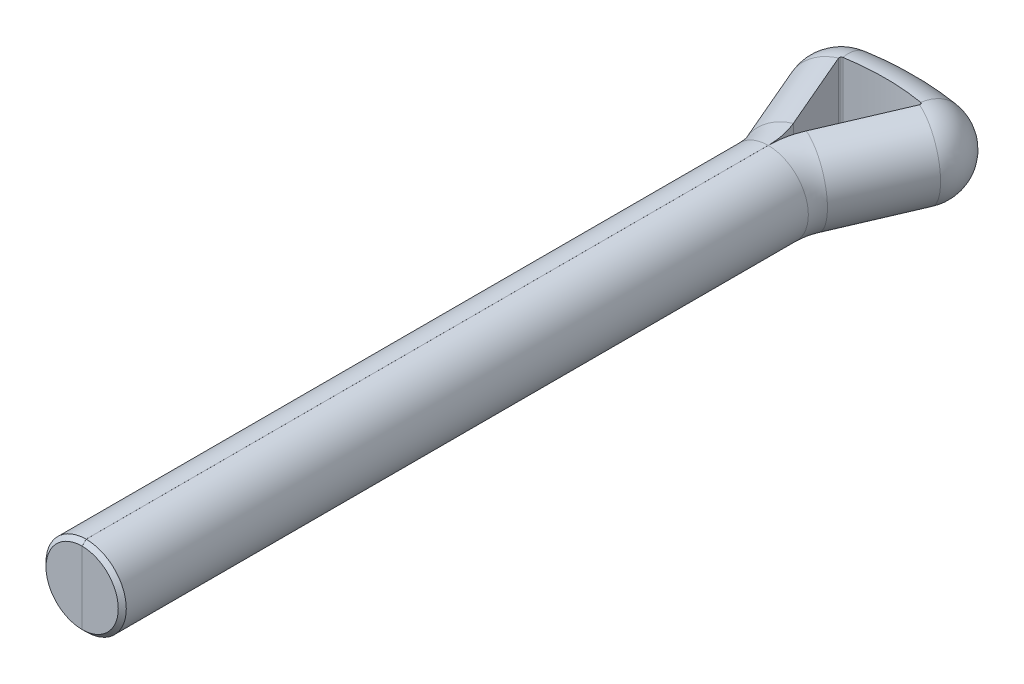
ISO-10303-21;
HEADER;
FILE_DESCRIPTION(('STEP AP214'),'2;1');
FILE_NAME('part.step','',(''),(''),'','','');
FILE_SCHEMA(('AUTOMOTIVE_DESIGN { 1 0 10303 214 1 1 1 1 }'));
ENDSEC;
DATA;
#1=APPLICATION_CONTEXT('core data for automotive mechanical design processes');
#2=APPLICATION_PROTOCOL_DEFINITION('international standard','automotive_design',2000,#1);
#3=PRODUCT_CONTEXT('',#1,'mechanical');
#4=PRODUCT('Part','Part','',(#3));
#5=PRODUCT_RELATED_PRODUCT_CATEGORY('part','',(#4));
#6=PRODUCT_DEFINITION_FORMATION('','',#4);
#7=PRODUCT_DEFINITION_CONTEXT('part definition',#1,'design');
#8=PRODUCT_DEFINITION('design','',#6,#7);
#9=PRODUCT_DEFINITION_SHAPE('','',#8);
#10=(LENGTH_UNIT() NAMED_UNIT(*) SI_UNIT(.MILLI.,.METRE.));
#11=(NAMED_UNIT(*) PLANE_ANGLE_UNIT() SI_UNIT($,.RADIAN.));
#12=(NAMED_UNIT(*) SI_UNIT($,.STERADIAN.) SOLID_ANGLE_UNIT());
#13=UNCERTAINTY_MEASURE_WITH_UNIT(LENGTH_MEASURE(1.E-05),#10,'distance_accuracy_value','');
#14=(GEOMETRIC_REPRESENTATION_CONTEXT(3) GLOBAL_UNCERTAINTY_ASSIGNED_CONTEXT((#13)) GLOBAL_UNIT_ASSIGNED_CONTEXT((#10,
#11,#12)) REPRESENTATION_CONTEXT('',''));
#15=CARTESIAN_POINT('',(0.,0.,0.));
#16=DIRECTION('',(0.,0.,1.));
#17=DIRECTION('',(1.,0.,0.));
#18=AXIS2_PLACEMENT_3D('',#15,#16,#17);
#19=CARTESIAN_POINT('',(0.,0.,-17.0892866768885));
#20=DIRECTION('',(0.,0.,1.));
#21=DIRECTION('',(1.,0.,0.));
#22=AXIS2_PLACEMENT_3D('',#19,#20,#21);
#23=CYLINDRICAL_SURFACE('',#22,1.);
#24=DIRECTION('',(0.,0.,1.));
#25=VECTOR('',#24,1.);
#26=CARTESIAN_POINT('',(0.000500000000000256,1.,-21.001));
#27=LINE('',#26,#25);
#28=CARTESIAN_POINT('',(0.000500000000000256,1.,-17.0892866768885));
#29=VERTEX_POINT('',#28);
#30=CARTESIAN_POINT('',(0.000500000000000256,1.,-0.100000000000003));
#31=VERTEX_POINT('',#30);
#32=EDGE_CURVE('E147',#29,#31,#27,.T.);
#33=ORIENTED_EDGE('',*,*,#32,.T.);
#34=CARTESIAN_POINT('',(0.,0.,-0.100000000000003));
#35=DIRECTION('',(0.,0.,1.));
#36=DIRECTION('',(1.,0.,0.));
#37=AXIS2_PLACEMENT_3D('',#34,#35,#36);
#38=CIRCLE('',#37,1.);
#39=CARTESIAN_POINT('',(0.000500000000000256,-1.,-0.100000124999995));
#40=VERTEX_POINT('',#39);
#41=EDGE_CURVE('E11',#31,#40,#38,.F.);
#42=ORIENTED_EDGE('',*,*,#41,.T.);
#43=DIRECTION('',(0.,0.,1.));
#44=VECTOR('',#43,1.);
#45=CARTESIAN_POINT('',(0.000500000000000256,-1.,-21.001));
#46=LINE('',#45,#44);
#47=CARTESIAN_POINT('',(0.000500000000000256,-1.,-17.0892866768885));
#48=VERTEX_POINT('',#47);
#49=EDGE_CURVE('E148',#48,#40,#46,.T.);
#50=ORIENTED_EDGE('',*,*,#49,.F.);
#51=CARTESIAN_POINT('',(0.,0.,-17.0892866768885));
#52=DIRECTION('',(0.,0.,1.));
#53=DIRECTION('',(1.,0.,0.));
#54=AXIS2_PLACEMENT_3D('',#51,#52,#53);
#55=CIRCLE('',#54,1.);
#56=EDGE_CURVE('E146',#48,#29,#55,.T.);
#57=ORIENTED_EDGE('',*,*,#56,.T.);
#58=EDGE_LOOP('',(#33,#42,#50,#57));
#59=FACE_BOUND('',#58,.T.);
#60=ADVANCED_FACE('F30',(#59),#23,.T.);
#61=CARTESIAN_POINT('',(0.,0.,0.));
#62=DIRECTION('',(0.,0.,1.));
#63=DIRECTION('',(1.,0.,0.));
#64=AXIS2_PLACEMENT_3D('',#61,#62,#63);
#65=PLANE('',#64);
#66=DIRECTION('',(0.,1.,0.));
#67=VECTOR('',#66,1.);
#68=CARTESIAN_POINT('',(0.000500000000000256,1.,0.));
#69=LINE('',#68,#67);
#70=CARTESIAN_POINT('',(0.000500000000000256,-0.8999998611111,0.));
#71=VERTEX_POINT('',#70);
#72=CARTESIAN_POINT('',(0.000500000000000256,0.8999998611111,0.));
#73=VERTEX_POINT('',#72);
#74=EDGE_CURVE('E314',#71,#73,#69,.T.);
#75=ORIENTED_EDGE('',*,*,#74,.F.);
#76=CARTESIAN_POINT('',(0.,0.,0.));
#77=DIRECTION('',(0.,0.,1.));
#78=DIRECTION('',(1.,0.,0.));
#79=AXIS2_PLACEMENT_3D('',#76,#77,#78);
#80=CIRCLE('',#79,0.9);
#81=EDGE_CURVE('E285',#71,#73,#80,.T.);
#82=ORIENTED_EDGE('',*,*,#81,.T.);
#83=EDGE_LOOP('',(#75,#82));
#84=FACE_BOUND('',#83,.T.);
#85=ADVANCED_FACE('F241',(#84),#65,.T.);
#86=CARTESIAN_POINT('',(0.,0.,-14.1365797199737));
#87=DIRECTION('',(0.,1.,0.));
#88=DIRECTION('',(0.,0.,1.));
#89=AXIS2_PLACEMENT_3D('',#86,#87,#88);
#90=CYLINDRICAL_SURFACE('',#89,5.86342028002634);
#91=DIRECTION('',(0.,-1.,0.));
#92=VECTOR('',#91,1.);
#93=CARTESIAN_POINT('',(0.97006774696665,1.,-19.9191972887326));
#94=LINE('',#93,#92);
#95=CARTESIAN_POINT('',(0.97006774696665,1.,-19.9191972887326));
#96=VERTEX_POINT('',#95);
#97=CARTESIAN_POINT('',(0.97006774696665,-1.,-19.9191972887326));
#98=VERTEX_POINT('',#97);
#99=EDGE_CURVE('E174',#96,#98,#94,.T.);
#100=ORIENTED_EDGE('',*,*,#99,.F.);
#101=CARTESIAN_POINT('',(0.,1.,-14.1365797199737));
#102=DIRECTION('',(0.,1.,0.));
#103=DIRECTION('',(0.,0.,1.));
#104=AXIS2_PLACEMENT_3D('',#101,#102,#103);
#105=CIRCLE('',#104,5.86342028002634);
#106=CARTESIAN_POINT('',(-0.97006774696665,1.,-19.9191972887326));
#107=VERTEX_POINT('',#106);
#108=EDGE_CURVE('E183',#96,#107,#105,.T.);
#109=ORIENTED_EDGE('',*,*,#108,.T.);
#110=DIRECTION('',(0.,-1.,0.));
#111=VECTOR('',#110,1.);
#112=CARTESIAN_POINT('',(-0.97006774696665,1.,-19.9191972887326));
#113=LINE('',#112,#111);
#114=CARTESIAN_POINT('',(-0.97006774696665,-1.,-19.9191972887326));
#115=VERTEX_POINT('',#114);
#116=EDGE_CURVE('E348',#107,#115,#113,.T.);
#117=ORIENTED_EDGE('',*,*,#116,.T.);
#118=CARTESIAN_POINT('',(0.,-1.,-14.1365797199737));
#119=DIRECTION('',(0.,1.,0.));
#120=DIRECTION('',(0.,0.,1.));
#121=AXIS2_PLACEMENT_3D('',#118,#119,#120);
#122=CIRCLE('',#121,5.86342028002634);
#123=EDGE_CURVE('E185',#98,#115,#122,.T.);
#124=ORIENTED_EDGE('',*,*,#123,.F.);
#125=EDGE_LOOP('',(#100,#109,#117,#124));
#126=FACE_BOUND('',#125,.T.);
#127=ADVANCED_FACE('F267',(#126),#90,.F.);
#128=CARTESIAN_POINT('',(0.,0.,-14.1365797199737));
#129=DIRECTION('',(0.,1.,0.));
#130=DIRECTION('',(0.,0.,1.));
#131=AXIS2_PLACEMENT_3D('',#128,#129,#130);
#132=TOROIDAL_SURFACE('',#131,5.86342028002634,1.);
#133=CARTESIAN_POINT('',(0.97006774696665,0.,-19.9191972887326));
#134=DIRECTION('',(0.986219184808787,0.,0.165444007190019));
#135=DIRECTION('',(0.165444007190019,0.,-0.986219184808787));
#136=AXIS2_PLACEMENT_3D('',#133,#134,#135);
#137=CIRCLE('',#136,1.);
#138=EDGE_CURVE('E171',#98,#96,#137,.T.);
#139=ORIENTED_EDGE('',*,*,#138,.F.);
#140=ORIENTED_EDGE('',*,*,#123,.T.);
#141=CARTESIAN_POINT('',(-0.97006774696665,0.,-19.9191972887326));
#142=DIRECTION('',(0.986219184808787,0.,-0.165444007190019));
#143=DIRECTION('',(-0.165444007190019,0.,-0.986219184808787));
#144=AXIS2_PLACEMENT_3D('',#141,#142,#143);
#145=CIRCLE('',#144,1.);
#146=EDGE_CURVE('E345',#115,#107,#145,.T.);
#147=ORIENTED_EDGE('',*,*,#146,.T.);
#148=ORIENTED_EDGE('',*,*,#108,.F.);
#149=EDGE_LOOP('',(#139,#140,#147,#148));
#150=FACE_BOUND('',#149,.T.);
#151=ADVANCED_FACE('F264',(#150),#132,.T.);
#152=CARTESIAN_POINT('',(0.961795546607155,0.,-19.8698863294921));
#153=DIRECTION('',(0.,1.,0.));
#154=DIRECTION('',(0.,0.,1.));
#155=AXIS2_PLACEMENT_3D('',#152,#153,#154);
#156=CYLINDRICAL_SURFACE('',#155,0.0500000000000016);
#157=DIRECTION('',(0.,-1.,0.));
#158=VECTOR('',#157,1.);
#159=CARTESIAN_POINT('',(1.00774905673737,1.,-19.8501816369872));
#160=LINE('',#159,#158);
#161=CARTESIAN_POINT('',(1.00774905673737,1.,-19.8501816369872));
#162=VERTEX_POINT('',#161);
#163=CARTESIAN_POINT('',(1.00774905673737,-1.,-19.8501816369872));
#164=VERTEX_POINT('',#163);
#165=EDGE_CURVE('E158',#162,#164,#160,.T.);
#166=ORIENTED_EDGE('',*,*,#165,.F.);
#167=CARTESIAN_POINT('',(0.961795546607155,1.,-19.8698863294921));
#168=DIRECTION('',(0.,1.,0.));
#169=DIRECTION('',(0.,0.,1.));
#170=AXIS2_PLACEMENT_3D('',#167,#168,#169);
#171=CIRCLE('',#170,0.0500000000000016);
#172=EDGE_CURVE('E177',#162,#96,#171,.T.);
#173=ORIENTED_EDGE('',*,*,#172,.T.);
#174=ORIENTED_EDGE('',*,*,#99,.T.);
#175=CARTESIAN_POINT('',(0.961795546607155,-1.,-19.8698863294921));
#176=DIRECTION('',(0.,1.,0.));
#177=DIRECTION('',(0.,0.,1.));
#178=AXIS2_PLACEMENT_3D('',#175,#176,#177);
#179=CIRCLE('',#178,0.0500000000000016);
#180=EDGE_CURVE('E180',#164,#98,#179,.T.);
#181=ORIENTED_EDGE('',*,*,#180,.F.);
#182=EDGE_LOOP('',(#166,#173,#174,#181));
#183=FACE_BOUND('',#182,.T.);
#184=ADVANCED_FACE('F260',(#183),#156,.F.);
#185=CARTESIAN_POINT('',(0.961795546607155,0.,-19.8698863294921));
#186=DIRECTION('',(0.,1.,0.));
#187=DIRECTION('',(0.,0.,1.));
#188=AXIS2_PLACEMENT_3D('',#185,#186,#187);
#189=DEGENERATE_TOROIDAL_SURFACE('',#188,0.0499999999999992,1.,.T.);
#190=CARTESIAN_POINT('',(1.00774905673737,0.,-19.8501816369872));
#191=DIRECTION('',(-0.394093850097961,0.,0.919070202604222));
#192=DIRECTION('',(0.919070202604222,0.,0.394093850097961));
#193=AXIS2_PLACEMENT_3D('',#190,#191,#192);
#194=CIRCLE('',#193,1.);
#195=EDGE_CURVE('E154',#164,#162,#194,.T.);
#196=ORIENTED_EDGE('',*,*,#195,.F.);
#197=ORIENTED_EDGE('',*,*,#180,.T.);
#198=ORIENTED_EDGE('',*,*,#138,.T.);
#199=ORIENTED_EDGE('',*,*,#172,.F.);
#200=EDGE_LOOP('',(#196,#197,#198,#199));
#201=FACE_BOUND('',#200,.T.);
#202=ADVANCED_FACE('F256',(#201),#189,.T.);
#203=CARTESIAN_POINT('',(0.161859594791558,1.,-17.8774743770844));
#204=DIRECTION('',(0.919070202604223,0.,0.39409385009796));
#205=DIRECTION('',(0.39409385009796,0.,-0.919070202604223));
#206=AXIS2_PLACEMENT_3D('',#203,#204,#205);
#207=PLANE('',#206);
#208=DIRECTION('',(0.,-1.,0.));
#209=VECTOR('',#208,1.);
#210=CARTESIAN_POINT('',(0.161859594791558,1.,-17.8774743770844));
#211=LINE('',#210,#209);
#212=CARTESIAN_POINT('',(0.161859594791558,1.,-17.8774743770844));
#213=VERTEX_POINT('',#212);
#214=CARTESIAN_POINT('',(0.161859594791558,-1.,-17.8774743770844));
#215=VERTEX_POINT('',#214);
#216=EDGE_CURVE('E153',#213,#215,#211,.T.);
#217=ORIENTED_EDGE('',*,*,#216,.F.);
#218=DIRECTION('',(0.39409385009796,0.,-0.919070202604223));
#219=VECTOR('',#218,1.);
#220=CARTESIAN_POINT('',(0.161859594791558,1.,-17.8774743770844));
#221=LINE('',#220,#219);
#222=EDGE_CURVE('E165',#213,#162,#221,.T.);
#223=ORIENTED_EDGE('',*,*,#222,.T.);
#224=ORIENTED_EDGE('',*,*,#165,.T.);
#225=DIRECTION('',(0.39409385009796,0.,-0.919070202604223));
#226=VECTOR('',#225,1.);
#227=CARTESIAN_POINT('',(0.161859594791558,-1.,-17.8774743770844));
#228=LINE('',#227,#226);
#229=EDGE_CURVE('E168',#215,#164,#228,.T.);
#230=ORIENTED_EDGE('',*,*,#229,.F.);
#231=EDGE_LOOP('',(#217,#223,#224,#230));
#232=FACE_BOUND('',#231,.T.);
#233=ADVANCED_FACE('F252',(#232),#207,.F.);
#234=CARTESIAN_POINT('',(0.161859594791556,0.,-17.8774743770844));
#235=DIRECTION('',(0.39409385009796,0.,-0.919070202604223));
#236=DIRECTION('',(-0.919070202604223,0.,-0.39409385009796));
#237=AXIS2_PLACEMENT_3D('',#234,#235,#236);
#238=CYLINDRICAL_SURFACE('',#237,1.);
#239=CARTESIAN_POINT('',(0.161859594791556,0.,-17.8774743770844));
#240=DIRECTION('',(-0.394093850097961,0.,0.919070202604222));
#241=DIRECTION('',(0.919070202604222,0.,0.394093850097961));
#242=AXIS2_PLACEMENT_3D('',#239,#240,#241);
#243=CIRCLE('',#242,1.);
#244=EDGE_CURVE('E358',#215,#213,#243,.T.);
#245=ORIENTED_EDGE('',*,*,#244,.F.);
#246=ORIENTED_EDGE('',*,*,#229,.T.);
#247=ORIENTED_EDGE('',*,*,#195,.T.);
#248=ORIENTED_EDGE('',*,*,#222,.F.);
#249=EDGE_LOOP('',(#245,#246,#247,#248));
#250=FACE_BOUND('',#249,.T.);
#251=ADVANCED_FACE('F249',(#250),#238,.T.);
#252=CARTESIAN_POINT('',(2.,0.,-17.0892866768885));
#253=DIRECTION('',(0.,-1.,0.));
#254=DIRECTION('',(0.,0.,-1.));
#255=AXIS2_PLACEMENT_3D('',#252,#253,#254);
#256=CYLINDRICAL_SURFACE('',#255,2.);
#257=CARTESIAN_POINT('',(2.,-1.,-17.0892866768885));
#258=DIRECTION('',(0.,-1.,0.));
#259=DIRECTION('',(0.,0.,-1.));
#260=AXIS2_PLACEMENT_3D('',#257,#258,#259);
#261=CIRCLE('',#260,2.);
#262=CARTESIAN_POINT('',(0.000500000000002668,-1.,-17.1340052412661));
#263=VERTEX_POINT('',#262);
#264=EDGE_CURVE('E143',#263,#215,#261,.T.);
#265=ORIENTED_EDGE('',*,*,#264,.F.);
#266=DIRECTION('',(0.,-1.,0.));
#267=VECTOR('',#266,1.);
#268=CARTESIAN_POINT('',(0.000500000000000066,0.,-17.134005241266));
#269=LINE('',#268,#267);
#270=CARTESIAN_POINT('',(0.000500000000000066,1.,-17.134005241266));
#271=VERTEX_POINT('',#270);
#272=EDGE_CURVE('E128',#271,#263,#269,.T.);
#273=ORIENTED_EDGE('',*,*,#272,.F.);
#274=CARTESIAN_POINT('',(2.,1.,-17.0892866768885));
#275=DIRECTION('',(0.,-1.,0.));
#276=DIRECTION('',(0.,0.,-1.));
#277=AXIS2_PLACEMENT_3D('',#274,#275,#276);
#278=CIRCLE('',#277,2.);
#279=EDGE_CURVE('E155',#271,#213,#278,.T.);
#280=ORIENTED_EDGE('',*,*,#279,.T.);
#281=ORIENTED_EDGE('',*,*,#216,.T.);
#282=EDGE_LOOP('',(#265,#273,#280,#281));
#283=FACE_BOUND('',#282,.T.);
#284=ADVANCED_FACE('F151',(#283),#256,.T.);
#285=CARTESIAN_POINT('',(2.,0.,-17.0892866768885));
#286=DIRECTION('',(0.,-1.,0.));
#287=DIRECTION('',(0.,0.,-1.));
#288=AXIS2_PLACEMENT_3D('',#285,#286,#287);
#289=TOROIDAL_SURFACE('',#288,2.,1.);
#290=ORIENTED_EDGE('',*,*,#56,.F.);
#291=EDGE_CURVE('E131',#263,#48,#46,.T.);
#292=ORIENTED_EDGE('',*,*,#291,.F.);
#293=ORIENTED_EDGE('',*,*,#264,.T.);
#294=ORIENTED_EDGE('',*,*,#244,.T.);
#295=ORIENTED_EDGE('',*,*,#279,.F.);
#296=EDGE_CURVE('E133',#271,#29,#27,.T.);
#297=ORIENTED_EDGE('',*,*,#296,.T.);
#298=EDGE_LOOP('',(#290,#292,#293,#294,#295,#297));
#299=FACE_BOUND('',#298,.T.);
#300=ADVANCED_FACE('F141',(#299),#289,.T.);
#301=DIRECTION('',(0.,0.,1.));
#302=VECTOR('',#301,1.);
#303=CARTESIAN_POINT('',(-0.000499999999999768,-1.,-21.001));
#304=LINE('',#303,#302);
#305=CARTESIAN_POINT('',(-0.000499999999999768,-1.,-17.0892866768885));
#306=VERTEX_POINT('',#305);
#307=CARTESIAN_POINT('',(-0.000499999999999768,-1.,-0.100000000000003));
#308=VERTEX_POINT('',#307);
#309=EDGE_CURVE('E301',#306,#308,#304,.T.);
#310=ORIENTED_EDGE('',*,*,#309,.T.);
#311=CARTESIAN_POINT('',(0.,0.,-0.100000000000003));
#312=DIRECTION('',(0.,0.,1.));
#313=DIRECTION('',(1.,0.,0.));
#314=AXIS2_PLACEMENT_3D('',#311,#312,#313);
#315=CIRCLE('',#314,1.);
#316=CARTESIAN_POINT('',(-0.000499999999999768,1.,-0.100000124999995));
#317=VERTEX_POINT('',#316);
#318=EDGE_CURVE('E288',#308,#317,#315,.F.);
#319=ORIENTED_EDGE('',*,*,#318,.T.);
#320=DIRECTION('',(0.,0.,1.));
#321=VECTOR('',#320,1.);
#322=CARTESIAN_POINT('',(-0.000499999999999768,1.,-21.001));
#323=LINE('',#322,#321);
#324=CARTESIAN_POINT('',(-0.000499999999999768,1.,-17.0892866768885));
#325=VERTEX_POINT('',#324);
#326=EDGE_CURVE('E313',#325,#317,#323,.T.);
#327=ORIENTED_EDGE('',*,*,#326,.F.);
#328=CARTESIAN_POINT('',(0.,0.,-17.0892866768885));
#329=DIRECTION('',(0.,0.,-1.));
#330=DIRECTION('',(-1.,0.,0.));
#331=AXIS2_PLACEMENT_3D('',#328,#329,#330);
#332=CIRCLE('',#331,1.);
#333=EDGE_CURVE('E308',#306,#325,#332,.T.);
#334=ORIENTED_EDGE('',*,*,#333,.F.);
#335=EDGE_LOOP('',(#310,#319,#327,#334));
#336=FACE_BOUND('',#335,.T.);
#337=ADVANCED_FACE('F239',(#336),#23,.T.);
#338=DIRECTION('',(0.,-1.,0.));
#339=VECTOR('',#338,1.);
#340=CARTESIAN_POINT('',(-0.000499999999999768,1.,0.));
#341=LINE('',#340,#339);
#342=CARTESIAN_POINT('',(-0.000499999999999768,0.8999998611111,0.));
#343=VERTEX_POINT('',#342);
#344=CARTESIAN_POINT('',(-0.000499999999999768,-0.8999998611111,0.));
#345=VERTEX_POINT('',#344);
#346=EDGE_CURVE('E137',#343,#345,#341,.T.);
#347=ORIENTED_EDGE('',*,*,#346,.F.);
#348=CARTESIAN_POINT('',(0.,0.,0.));
#349=DIRECTION('',(0.,0.,1.));
#350=DIRECTION('',(1.,0.,0.));
#351=AXIS2_PLACEMENT_3D('',#348,#349,#350);
#352=CIRCLE('',#351,0.9);
#353=EDGE_CURVE('E187',#343,#345,#352,.T.);
#354=ORIENTED_EDGE('',*,*,#353,.T.);
#355=EDGE_LOOP('',(#347,#354));
#356=FACE_BOUND('',#355,.T.);
#357=ADVANCED_FACE('F235',(#356),#65,.T.);
#358=CARTESIAN_POINT('',(-0.961795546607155,0.,-19.8698863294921));
#359=DIRECTION('',(0.,-1.,0.));
#360=DIRECTION('',(0.,0.,-1.));
#361=AXIS2_PLACEMENT_3D('',#358,#359,#360);
#362=CYLINDRICAL_SURFACE('',#361,0.0500000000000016);
#363=DIRECTION('',(0.,-1.,0.));
#364=VECTOR('',#363,1.);
#365=CARTESIAN_POINT('',(-1.00774905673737,1.,-19.8501816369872));
#366=LINE('',#365,#364);
#367=CARTESIAN_POINT('',(-1.00774905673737,1.,-19.8501816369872));
#368=VERTEX_POINT('',#367);
#369=CARTESIAN_POINT('',(-1.00774905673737,-1.,-19.8501816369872));
#370=VERTEX_POINT('',#369);
#371=EDGE_CURVE('E336',#368,#370,#366,.T.);
#372=ORIENTED_EDGE('',*,*,#371,.T.);
#373=CARTESIAN_POINT('',(-0.961795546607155,-1.,-19.8698863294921));
#374=DIRECTION('',(0.,-1.,0.));
#375=DIRECTION('',(0.,0.,-1.));
#376=AXIS2_PLACEMENT_3D('',#373,#374,#375);
#377=CIRCLE('',#376,0.0500000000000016);
#378=EDGE_CURVE('E351',#370,#115,#377,.T.);
#379=ORIENTED_EDGE('',*,*,#378,.T.);
#380=ORIENTED_EDGE('',*,*,#116,.F.);
#381=CARTESIAN_POINT('',(-0.961795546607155,1.,-19.8698863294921));
#382=DIRECTION('',(0.,-1.,0.));
#383=DIRECTION('',(0.,0.,-1.));
#384=AXIS2_PLACEMENT_3D('',#381,#382,#383);
#385=CIRCLE('',#384,0.0500000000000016);
#386=EDGE_CURVE('E354',#368,#107,#385,.T.);
#387=ORIENTED_EDGE('',*,*,#386,.F.);
#388=EDGE_LOOP('',(#372,#379,#380,#387));
#389=FACE_BOUND('',#388,.T.);
#390=ADVANCED_FACE('F231',(#389),#362,.F.);
#391=CARTESIAN_POINT('',(-0.961795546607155,0.,-19.8698863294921));
#392=DIRECTION('',(0.,-1.,0.));
#393=DIRECTION('',(0.,0.,-1.));
#394=AXIS2_PLACEMENT_3D('',#391,#392,#393);
#395=DEGENERATE_TOROIDAL_SURFACE('',#394,0.0499999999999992,1.,.T.);
#396=CARTESIAN_POINT('',(-1.00774905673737,0.,-19.8501816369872));
#397=DIRECTION('',(-0.394093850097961,0.,-0.919070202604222));
#398=DIRECTION('',(-0.919070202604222,0.,0.394093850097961));
#399=AXIS2_PLACEMENT_3D('',#396,#397,#398);
#400=CIRCLE('',#399,1.);
#401=EDGE_CURVE('E333',#370,#368,#400,.T.);
#402=ORIENTED_EDGE('',*,*,#401,.T.);
#403=ORIENTED_EDGE('',*,*,#386,.T.);
#404=ORIENTED_EDGE('',*,*,#146,.F.);
#405=ORIENTED_EDGE('',*,*,#378,.F.);
#406=EDGE_LOOP('',(#402,#403,#404,#405));
#407=FACE_BOUND('',#406,.T.);
#408=ADVANCED_FACE('F227',(#407),#395,.T.);
#409=CARTESIAN_POINT('',(-0.161859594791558,1.,-17.8774743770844));
#410=DIRECTION('',(0.919070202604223,0.,-0.39409385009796));
#411=DIRECTION('',(-0.39409385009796,0.,-0.919070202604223));
#412=AXIS2_PLACEMENT_3D('',#409,#410,#411);
#413=PLANE('',#412);
#414=DIRECTION('',(0.,-1.,0.));
#415=VECTOR('',#414,1.);
#416=CARTESIAN_POINT('',(-0.161859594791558,1.,-17.8774743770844));
#417=LINE('',#416,#415);
#418=CARTESIAN_POINT('',(-0.161859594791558,1.,-17.8774743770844));
#419=VERTEX_POINT('',#418);
#420=CARTESIAN_POINT('',(-0.161859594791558,-1.,-17.8774743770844));
#421=VERTEX_POINT('',#420);
#422=EDGE_CURVE('E326',#419,#421,#417,.T.);
#423=ORIENTED_EDGE('',*,*,#422,.T.);
#424=DIRECTION('',(-0.39409385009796,0.,-0.919070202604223));
#425=VECTOR('',#424,1.);
#426=CARTESIAN_POINT('',(-0.161859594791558,-1.,-17.8774743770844));
#427=LINE('',#426,#425);
#428=EDGE_CURVE('E339',#421,#370,#427,.T.);
#429=ORIENTED_EDGE('',*,*,#428,.T.);
#430=ORIENTED_EDGE('',*,*,#371,.F.);
#431=DIRECTION('',(-0.39409385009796,0.,-0.919070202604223));
#432=VECTOR('',#431,1.);
#433=CARTESIAN_POINT('',(-0.161859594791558,1.,-17.8774743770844));
#434=LINE('',#433,#432);
#435=EDGE_CURVE('E342',#419,#368,#434,.T.);
#436=ORIENTED_EDGE('',*,*,#435,.F.);
#437=EDGE_LOOP('',(#423,#429,#430,#436));
#438=FACE_BOUND('',#437,.T.);
#439=ADVANCED_FACE('F223',(#438),#413,.T.);
#440=CARTESIAN_POINT('',(-0.161859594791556,0.,-17.8774743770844));
#441=DIRECTION('',(-0.39409385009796,0.,-0.919070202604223));
#442=DIRECTION('',(-0.919070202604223,0.,0.39409385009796));
#443=AXIS2_PLACEMENT_3D('',#440,#441,#442);
#444=CYLINDRICAL_SURFACE('',#443,1.);
#445=CARTESIAN_POINT('',(-0.161859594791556,0.,-17.8774743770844));
#446=DIRECTION('',(-0.394093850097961,0.,-0.919070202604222));
#447=DIRECTION('',(-0.919070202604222,0.,0.394093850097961));
#448=AXIS2_PLACEMENT_3D('',#445,#446,#447);
#449=CIRCLE('',#448,1.);
#450=EDGE_CURVE('E323',#421,#419,#449,.T.);
#451=ORIENTED_EDGE('',*,*,#450,.T.);
#452=ORIENTED_EDGE('',*,*,#435,.T.);
#453=ORIENTED_EDGE('',*,*,#401,.F.);
#454=ORIENTED_EDGE('',*,*,#428,.F.);
#455=EDGE_LOOP('',(#451,#452,#453,#454));
#456=FACE_BOUND('',#455,.T.);
#457=ADVANCED_FACE('F219',(#456),#444,.T.);
#458=CARTESIAN_POINT('',(-2.,0.,-17.0892866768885));
#459=DIRECTION('',(0.,1.,0.));
#460=DIRECTION('',(0.,0.,1.));
#461=AXIS2_PLACEMENT_3D('',#458,#459,#460);
#462=CYLINDRICAL_SURFACE('',#461,2.);
#463=DIRECTION('',(0.,1.,0.));
#464=VECTOR('',#463,1.);
#465=CARTESIAN_POINT('',(-0.000499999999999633,0.,-17.134005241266));
#466=LINE('',#465,#464);
#467=CARTESIAN_POINT('',(-0.000499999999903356,1.,-17.1340052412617));
#468=VERTEX_POINT('',#467);
#469=CARTESIAN_POINT('',(-0.000499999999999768,-1.,-17.1340052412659));
#470=VERTEX_POINT('',#469);
#471=EDGE_CURVE('E317',#468,#470,#466,.F.);
#472=ORIENTED_EDGE('',*,*,#471,.T.);
#473=CARTESIAN_POINT('',(-2.,-1.,-17.0892866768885));
#474=DIRECTION('',(0.,1.,0.));
#475=DIRECTION('',(0.,0.,1.));
#476=AXIS2_PLACEMENT_3D('',#473,#474,#475);
#477=CIRCLE('',#476,2.);
#478=EDGE_CURVE('E329',#470,#421,#477,.T.);
#479=ORIENTED_EDGE('',*,*,#478,.T.);
#480=ORIENTED_EDGE('',*,*,#422,.F.);
#481=CARTESIAN_POINT('',(-2.,1.,-17.0892866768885));
#482=DIRECTION('',(0.,1.,0.));
#483=DIRECTION('',(0.,0.,1.));
#484=AXIS2_PLACEMENT_3D('',#481,#482,#483);
#485=CIRCLE('',#484,2.);
#486=EDGE_CURVE('E331',#468,#419,#485,.T.);
#487=ORIENTED_EDGE('',*,*,#486,.F.);
#488=EDGE_LOOP('',(#472,#479,#480,#487));
#489=FACE_BOUND('',#488,.T.);
#490=ADVANCED_FACE('F215',(#489),#462,.T.);
#491=CARTESIAN_POINT('',(-2.,0.,-17.0892866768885));
#492=DIRECTION('',(0.,1.,0.));
#493=DIRECTION('',(0.,0.,1.));
#494=AXIS2_PLACEMENT_3D('',#491,#492,#493);
#495=TOROIDAL_SURFACE('',#494,2.,1.);
#496=EDGE_CURVE('E309',#470,#306,#304,.T.);
#497=ORIENTED_EDGE('',*,*,#496,.T.);
#498=ORIENTED_EDGE('',*,*,#333,.T.);
#499=EDGE_CURVE('E310',#468,#325,#323,.T.);
#500=ORIENTED_EDGE('',*,*,#499,.F.);
#501=ORIENTED_EDGE('',*,*,#486,.T.);
#502=ORIENTED_EDGE('',*,*,#450,.F.);
#503=ORIENTED_EDGE('',*,*,#478,.F.);
#504=EDGE_LOOP('',(#497,#498,#500,#501,#502,#503));
#505=FACE_BOUND('',#504,.T.);
#506=ADVANCED_FACE('F209',(#505),#495,.T.);
#507=CARTESIAN_POINT('',(-0.000499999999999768,1.,-21.001));
#508=DIRECTION('',(-1.,0.,0.));
#509=DIRECTION('',(0.,0.,1.));
#510=AXIS2_PLACEMENT_3D('',#507,#508,#509);
#511=PLANE('',#510);
#512=ORIENTED_EDGE('',*,*,#346,.T.);
#513=CARTESIAN_POINT('',(-0.000499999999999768,-0.8999998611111,0.));
#514=CARTESIAN_POINT('',(-0.000499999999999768,-0.916666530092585,-0.0166666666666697));
#515=CARTESIAN_POINT('',(-0.000499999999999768,-0.93333319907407,-0.0333333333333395));
#516=CARTESIAN_POINT('',(-0.000499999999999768,-0.966666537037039,-0.0666666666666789));
#517=CARTESIAN_POINT('',(-0.000499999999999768,-0.983333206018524,-0.0833333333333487));
#518=CARTESIAN_POINT('',(-0.000499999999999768,-0.999999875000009,-0.100000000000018));
#519=B_SPLINE_CURVE_WITH_KNOTS('',3,(#513,#514,#515,#516,#517,#518),.UNSPECIFIED.,.F.,.F.,(4,2,
4),(0.,0.070710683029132,0.141421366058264),.UNSPECIFIED.);
#520=EDGE_CURVE('E196',#345,#308,#519,.T.);
#521=ORIENTED_EDGE('',*,*,#520,.T.);
#522=ORIENTED_EDGE('',*,*,#309,.F.);
#523=ORIENTED_EDGE('',*,*,#496,.F.);
#524=ORIENTED_EDGE('',*,*,#471,.F.);
#525=ORIENTED_EDGE('',*,*,#499,.T.);
#526=ORIENTED_EDGE('',*,*,#326,.T.);
#527=CARTESIAN_POINT('',(-0.00049999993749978,0.999999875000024,-0.100000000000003));
#528=CARTESIAN_POINT('',(-0.000499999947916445,0.983333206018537,-0.0833333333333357));
#529=CARTESIAN_POINT('',(-0.000499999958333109,0.96666653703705,-0.0666666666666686));
#530=CARTESIAN_POINT('',(-0.000499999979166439,0.933333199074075,-0.0333333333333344));
#531=CARTESIAN_POINT('',(-0.000499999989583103,0.916666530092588,-0.0166666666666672));
#532=CARTESIAN_POINT('',(-0.000499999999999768,0.8999998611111,0.));
#533=B_SPLINE_CURVE_WITH_KNOTS('',3,(#527,#528,#529,#530,#531,#532),.UNSPECIFIED.,.F.,.F.,(4,2,
4),(0.,0.070710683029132,0.141421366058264),.UNSPECIFIED.);
#534=EDGE_CURVE('E190',#317,#343,#533,.T.);
#535=ORIENTED_EDGE('',*,*,#534,.T.);
#536=EDGE_LOOP('',(#512,#521,#522,#523,#524,#525,#526,#535));
#537=FACE_BOUND('',#536,.T.);
#538=ADVANCED_FACE('F204',(#537),#511,.F.);
#539=CARTESIAN_POINT('',(0.000500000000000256,1.,-21.001));
#540=DIRECTION('',(1.,0.,0.));
#541=DIRECTION('',(0.,0.,-1.));
#542=AXIS2_PLACEMENT_3D('',#539,#540,#541);
#543=PLANE('',#542);
#544=ORIENTED_EDGE('',*,*,#74,.T.);
#545=CARTESIAN_POINT('',(0.000500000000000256,0.8999998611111,0.));
#546=CARTESIAN_POINT('',(0.000500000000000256,0.916666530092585,-0.0166666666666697));
#547=CARTESIAN_POINT('',(0.000500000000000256,0.93333319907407,-0.0333333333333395));
#548=CARTESIAN_POINT('',(0.000500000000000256,0.966666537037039,-0.0666666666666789));
#549=CARTESIAN_POINT('',(0.000500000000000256,0.983333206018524,-0.0833333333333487));
#550=CARTESIAN_POINT('',(0.000500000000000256,0.999999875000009,-0.100000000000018));
#551=B_SPLINE_CURVE_WITH_KNOTS('',3,(#545,#546,#547,#548,#549,#550),.UNSPECIFIED.,.F.,.F.,(4,2,
4),(0.,0.070710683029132,0.141421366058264),.UNSPECIFIED.);
#552=EDGE_CURVE('E39',#73,#31,#551,.T.);
#553=ORIENTED_EDGE('',*,*,#552,.T.);
#554=ORIENTED_EDGE('',*,*,#32,.F.);
#555=ORIENTED_EDGE('',*,*,#296,.F.);
#556=ORIENTED_EDGE('',*,*,#272,.T.);
#557=ORIENTED_EDGE('',*,*,#291,.T.);
#558=ORIENTED_EDGE('',*,*,#49,.T.);
#559=CARTESIAN_POINT('',(0.000499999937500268,-0.999999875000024,-0.100000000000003));
#560=CARTESIAN_POINT('',(0.000499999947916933,-0.983333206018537,-0.0833333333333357));
#561=CARTESIAN_POINT('',(0.000499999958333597,-0.96666653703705,-0.0666666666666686));
#562=CARTESIAN_POINT('',(0.000499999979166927,-0.933333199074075,-0.0333333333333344));
#563=CARTESIAN_POINT('',(0.000499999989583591,-0.916666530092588,-0.0166666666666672));
#564=CARTESIAN_POINT('',(0.000500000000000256,-0.8999998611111,0.));
#565=B_SPLINE_CURVE_WITH_KNOTS('',3,(#559,#560,#561,#562,#563,#564),.UNSPECIFIED.,.F.,.F.,(4,2,
4),(0.,0.070710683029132,0.141421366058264),.UNSPECIFIED.);
#566=EDGE_CURVE('E284',#40,#71,#565,.T.);
#567=ORIENTED_EDGE('',*,*,#566,.T.);
#568=EDGE_LOOP('',(#544,#553,#554,#555,#556,#557,#558,#567));
#569=FACE_BOUND('',#568,.T.);
#570=ADVANCED_FACE('F130',(#569),#543,.F.);
#571=CARTESIAN_POINT('',(0.,0.,0.));
#572=DIRECTION('',(0.,0.,-1.));
#573=DIRECTION('',(-1.,0.,0.));
#574=AXIS2_PLACEMENT_3D('',#571,#572,#573);
#575=CONICAL_SURFACE('',#574,0.9,0.78539816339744);
#576=ORIENTED_EDGE('',*,*,#534,.F.);
#577=ORIENTED_EDGE('',*,*,#318,.F.);
#578=ORIENTED_EDGE('',*,*,#520,.F.);
#579=ORIENTED_EDGE('',*,*,#353,.F.);
#580=EDGE_LOOP('',(#576,#577,#578,#579));
#581=FACE_BOUND('',#580,.T.);
#582=ADVANCED_FACE('F201',(#581),#575,.T.);
#583=CARTESIAN_POINT('',(0.,0.,0.));
#584=DIRECTION('',(0.,0.,-1.));
#585=DIRECTION('',(-1.,0.,0.));
#586=AXIS2_PLACEMENT_3D('',#583,#584,#585);
#587=CONICAL_SURFACE('',#586,0.9,0.78539816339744);
#588=ORIENTED_EDGE('',*,*,#566,.F.);
#589=ORIENTED_EDGE('',*,*,#41,.F.);
#590=ORIENTED_EDGE('',*,*,#552,.F.);
#591=ORIENTED_EDGE('',*,*,#81,.F.);
#592=EDGE_LOOP('',(#588,#589,#590,#591));
#593=FACE_BOUND('',#592,.T.);
#594=ADVANCED_FACE('F32',(#593),#587,.T.);
#595=CLOSED_SHELL('',(#60,#85,#127,#151,#184,#202,#233,#251,#284,#300,#337,#357,#390,#408,#439,
#457,#490,#506,#538,#570,#582,#594));
#596=MANIFOLD_SOLID_BREP('B2',#595);
#597=ADVANCED_BREP_SHAPE_REPRESENTATION('',(#18,#596),#14);
#598=SHAPE_DEFINITION_REPRESENTATION(#9,#597);
ENDSEC;
END-ISO-10303-21;
